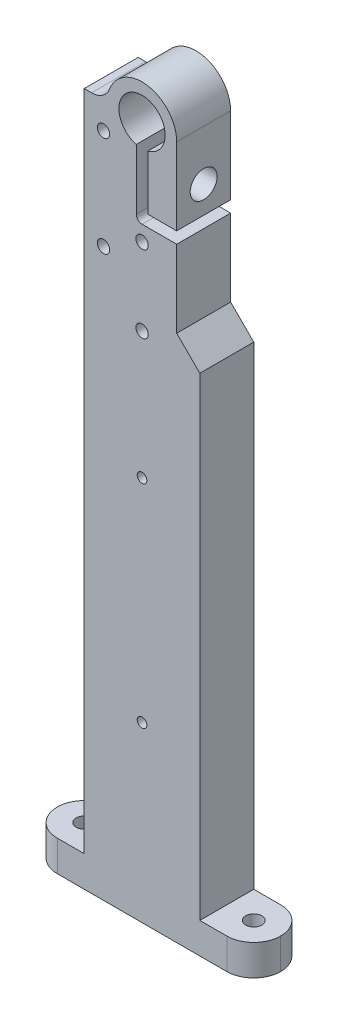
ISO-10303-21;
HEADER;
FILE_DESCRIPTION(('STEP AP214'),'2;1');
FILE_NAME('part.step','',(''),(''),'','','');
FILE_SCHEMA(('AUTOMOTIVE_DESIGN { 1 0 10303 214 1 1 1 1 }'));
ENDSEC;
DATA;
#1=APPLICATION_CONTEXT('core data for automotive mechanical design processes');
#2=APPLICATION_PROTOCOL_DEFINITION('international standard','automotive_design',2000,#1);
#3=PRODUCT_CONTEXT('',#1,'mechanical');
#4=PRODUCT('Part','Part','',(#3));
#5=PRODUCT_RELATED_PRODUCT_CATEGORY('part','',(#4));
#6=PRODUCT_DEFINITION_FORMATION('','',#4);
#7=PRODUCT_DEFINITION_CONTEXT('part definition',#1,'design');
#8=PRODUCT_DEFINITION('design','',#6,#7);
#9=PRODUCT_DEFINITION_SHAPE('','',#8);
#10=(LENGTH_UNIT() NAMED_UNIT(*) SI_UNIT(.MILLI.,.METRE.));
#11=(NAMED_UNIT(*) PLANE_ANGLE_UNIT() SI_UNIT($,.RADIAN.));
#12=(NAMED_UNIT(*) SI_UNIT($,.STERADIAN.) SOLID_ANGLE_UNIT());
#13=UNCERTAINTY_MEASURE_WITH_UNIT(LENGTH_MEASURE(1.E-05),#10,'distance_accuracy_value','');
#14=(GEOMETRIC_REPRESENTATION_CONTEXT(3) GLOBAL_UNCERTAINTY_ASSIGNED_CONTEXT((#13)) GLOBAL_UNIT_ASSIGNED_CONTEXT((#10,
#11,#12)) REPRESENTATION_CONTEXT('',''));
#15=CARTESIAN_POINT('',(0.,0.,0.));
#16=DIRECTION('',(0.,0.,1.));
#17=DIRECTION('',(1.,0.,0.));
#18=AXIS2_PLACEMENT_3D('',#15,#16,#17);
#19=CARTESIAN_POINT('',(0.,0.,14.));
#20=DIRECTION('',(1.,0.,0.));
#21=DIRECTION('',(0.,0.,-1.));
#22=AXIS2_PLACEMENT_3D('',#19,#20,#21);
#23=PLANE('',#22);
#24=CARTESIAN_POINT('',(0.,167.,7.));
#25=DIRECTION('',(1.,0.,0.));
#26=DIRECTION('',(0.,0.,-1.));
#27=AXIS2_PLACEMENT_3D('',#24,#25,#26);
#28=CIRCLE('',#27,2.5);
#29=CARTESIAN_POINT('',(0.,167.,4.5));
#30=VERTEX_POINT('',#29);
#31=EDGE_CURVE('E355',#30,#30,#28,.T.);
#32=ORIENTED_EDGE('',*,*,#31,.T.);
#33=EDGE_LOOP('',(#32));
#34=FACE_BOUND('',#33,.T.);
#35=DIRECTION('',(0.,-1.,0.));
#36=VECTOR('',#35,1.);
#37=CARTESIAN_POINT('',(0.,0.,14.));
#38=LINE('',#37,#36);
#39=CARTESIAN_POINT('',(0.,180.,14.));
#40=VERTEX_POINT('',#39);
#41=CARTESIAN_POINT('',(0.,8.,14.));
#42=VERTEX_POINT('',#41);
#43=EDGE_CURVE('E271',#40,#42,#38,.T.);
#44=ORIENTED_EDGE('',*,*,#43,.F.);
#45=DIRECTION('',(0.,0.,-1.));
#46=VECTOR('',#45,1.);
#47=CARTESIAN_POINT('',(0.,180.,14.));
#48=LINE('',#47,#46);
#49=CARTESIAN_POINT('',(0.,180.,0.));
#50=VERTEX_POINT('',#49);
#51=EDGE_CURVE('E231',#40,#50,#48,.T.);
#52=ORIENTED_EDGE('',*,*,#51,.T.);
#53=DIRECTION('',(0.,-1.,0.));
#54=VECTOR('',#53,1.);
#55=CARTESIAN_POINT('',(0.,0.,0.));
#56=LINE('',#55,#54);
#57=CARTESIAN_POINT('',(0.,8.,0.));
#58=VERTEX_POINT('',#57);
#59=EDGE_CURVE('E275',#50,#58,#56,.T.);
#60=ORIENTED_EDGE('',*,*,#59,.T.);
#61=DIRECTION('',(0.,0.,1.));
#62=VECTOR('',#61,1.);
#63=CARTESIAN_POINT('',(0.,8.,14.));
#64=LINE('',#63,#62);
#65=EDGE_CURVE('E277',#58,#42,#64,.T.);
#66=ORIENTED_EDGE('',*,*,#65,.T.);
#67=EDGE_LOOP('',(#44,#52,#60,#66));
#68=FACE_BOUND('',#67,.T.);
#69=ADVANCED_FACE('F38',(#34,#68),#23,.F.);
#70=CARTESIAN_POINT('',(0.,0.,14.));
#71=DIRECTION('',(0.,1.,0.));
#72=DIRECTION('',(0.,0.,1.));
#73=AXIS2_PLACEMENT_3D('',#70,#71,#72);
#74=PLANE('',#73);
#75=CARTESIAN_POINT('',(37.,0.,7.));
#76=DIRECTION('',(0.,-1.,0.));
#77=DIRECTION('',(0.,0.,-1.));
#78=AXIS2_PLACEMENT_3D('',#75,#76,#77);
#79=CIRCLE('',#78,2.1);
#80=CARTESIAN_POINT('',(37.,0.,4.9));
#81=VERTEX_POINT('',#80);
#82=EDGE_CURVE('E302',#81,#81,#79,.T.);
#83=ORIENTED_EDGE('',*,*,#82,.F.);
#84=EDGE_LOOP('',(#83));
#85=FACE_BOUND('',#84,.T.);
#86=CARTESIAN_POINT('',(-7.,0.,7.));
#87=DIRECTION('',(0.,-1.,0.));
#88=DIRECTION('',(0.,0.,-1.));
#89=AXIS2_PLACEMENT_3D('',#86,#87,#88);
#90=CIRCLE('',#89,2.1);
#91=CARTESIAN_POINT('',(-7.,0.,4.9));
#92=VERTEX_POINT('',#91);
#93=EDGE_CURVE('E295',#92,#92,#90,.T.);
#94=ORIENTED_EDGE('',*,*,#93,.F.);
#95=EDGE_LOOP('',(#94));
#96=FACE_BOUND('',#95,.T.);
#97=DIRECTION('',(1.,0.,0.));
#98=VECTOR('',#97,1.);
#99=CARTESIAN_POINT('',(0.,0.,0.));
#100=LINE('',#99,#98);
#101=CARTESIAN_POINT('',(-7.,0.,0.));
#102=VERTEX_POINT('',#101);
#103=CARTESIAN_POINT('',(37.,0.,0.));
#104=VERTEX_POINT('',#103);
#105=EDGE_CURVE('E272',#102,#104,#100,.T.);
#106=ORIENTED_EDGE('',*,*,#105,.T.);
#107=CARTESIAN_POINT('',(37.,0.,7.));
#108=DIRECTION('',(0.,1.,0.));
#109=DIRECTION('',(0.,0.,1.));
#110=AXIS2_PLACEMENT_3D('',#107,#108,#109);
#111=CIRCLE('',#110,7.);
#112=CARTESIAN_POINT('',(44.,0.,7.));
#113=VERTEX_POINT('',#112);
#114=EDGE_CURVE('E255',#104,#113,#111,.F.);
#115=ORIENTED_EDGE('',*,*,#114,.T.);
#116=CARTESIAN_POINT('',(37.,0.,7.));
#117=DIRECTION('',(0.,1.,0.));
#118=DIRECTION('',(0.,0.,1.));
#119=AXIS2_PLACEMENT_3D('',#116,#117,#118);
#120=CIRCLE('',#119,7.);
#121=CARTESIAN_POINT('',(37.,0.,14.));
#122=VERTEX_POINT('',#121);
#123=EDGE_CURVE('E257',#113,#122,#120,.F.);
#124=ORIENTED_EDGE('',*,*,#123,.T.);
#125=DIRECTION('',(1.,0.,0.));
#126=VECTOR('',#125,1.);
#127=CARTESIAN_POINT('',(0.,0.,14.));
#128=LINE('',#127,#126);
#129=CARTESIAN_POINT('',(-7.,0.,14.));
#130=VERTEX_POINT('',#129);
#131=EDGE_CURVE('E280',#130,#122,#128,.T.);
#132=ORIENTED_EDGE('',*,*,#131,.F.);
#133=CARTESIAN_POINT('',(-7.,0.,7.));
#134=DIRECTION('',(0.,1.,0.));
#135=DIRECTION('',(0.,0.,1.));
#136=AXIS2_PLACEMENT_3D('',#133,#134,#135);
#137=CIRCLE('',#136,7.);
#138=CARTESIAN_POINT('',(-14.,0.,7.));
#139=VERTEX_POINT('',#138);
#140=EDGE_CURVE('E259',#130,#139,#137,.F.);
#141=ORIENTED_EDGE('',*,*,#140,.T.);
#142=CARTESIAN_POINT('',(-7.,0.,7.));
#143=DIRECTION('',(0.,1.,0.));
#144=DIRECTION('',(0.,0.,1.));
#145=AXIS2_PLACEMENT_3D('',#142,#143,#144);
#146=CIRCLE('',#145,7.);
#147=EDGE_CURVE('E261',#139,#102,#146,.F.);
#148=ORIENTED_EDGE('',*,*,#147,.T.);
#149=EDGE_LOOP('',(#106,#115,#124,#132,#141,#148));
#150=FACE_BOUND('',#149,.T.);
#151=ADVANCED_FACE('F438',(#85,#96,#150),#74,.F.);
#152=CARTESIAN_POINT('',(30.,0.,14.));
#153=DIRECTION('',(-1.,0.,0.));
#154=DIRECTION('',(0.,0.,1.));
#155=AXIS2_PLACEMENT_3D('',#152,#153,#154);
#156=PLANE('',#155);
#157=DIRECTION('',(0.,1.,0.));
#158=VECTOR('',#157,1.);
#159=CARTESIAN_POINT('',(30.,0.,0.));
#160=LINE('',#159,#158);
#161=CARTESIAN_POINT('',(30.,8.,0.));
#162=VERTEX_POINT('',#161);
#163=CARTESIAN_POINT('',(30.,131.,0.));
#164=VERTEX_POINT('',#163);
#165=EDGE_CURVE('E269',#162,#164,#160,.T.);
#166=ORIENTED_EDGE('',*,*,#165,.T.);
#167=DIRECTION('',(0.,0.,1.));
#168=VECTOR('',#167,1.);
#169=CARTESIAN_POINT('',(30.,131.,14.));
#170=LINE('',#169,#168);
#171=CARTESIAN_POINT('',(30.,131.,14.));
#172=VERTEX_POINT('',#171);
#173=EDGE_CURVE('E203',#164,#172,#170,.T.);
#174=ORIENTED_EDGE('',*,*,#173,.T.);
#175=DIRECTION('',(0.,1.,0.));
#176=VECTOR('',#175,1.);
#177=CARTESIAN_POINT('',(30.,0.,14.));
#178=LINE('',#177,#176);
#179=CARTESIAN_POINT('',(30.,8.,14.));
#180=VERTEX_POINT('',#179);
#181=EDGE_CURVE('E268',#180,#172,#178,.T.);
#182=ORIENTED_EDGE('',*,*,#181,.F.);
#183=DIRECTION('',(0.,0.,-1.));
#184=VECTOR('',#183,1.);
#185=CARTESIAN_POINT('',(30.,8.,14.));
#186=LINE('',#185,#184);
#187=EDGE_CURVE('E286',#180,#162,#186,.T.);
#188=ORIENTED_EDGE('',*,*,#187,.T.);
#189=EDGE_LOOP('',(#166,#174,#182,#188));
#190=FACE_BOUND('',#189,.T.);
#191=ADVANCED_FACE('F410',(#190),#156,.F.);
#192=CARTESIAN_POINT('',(0.,0.,14.));
#193=DIRECTION('',(0.,0.,-1.));
#194=DIRECTION('',(-1.,0.,0.));
#195=AXIS2_PLACEMENT_3D('',#192,#193,#194);
#196=PLANE('',#195);
#197=CARTESIAN_POINT('',(15.,153.,14.));
#198=DIRECTION('',(0.,0.,1.));
#199=DIRECTION('',(1.,0.,0.));
#200=AXIS2_PLACEMENT_3D('',#197,#198,#199);
#201=CIRCLE('',#200,1.59999999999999);
#202=CARTESIAN_POINT('',(16.6,153.,14.));
#203=VERTEX_POINT('',#202);
#204=EDGE_CURVE('E392',#203,#203,#201,.T.);
#205=ORIENTED_EDGE('',*,*,#204,.F.);
#206=EDGE_LOOP('',(#205));
#207=FACE_BOUND('',#206,.T.);
#208=CARTESIAN_POINT('',(15.,133.,14.));
#209=DIRECTION('',(0.,0.,1.));
#210=DIRECTION('',(1.,0.,0.));
#211=AXIS2_PLACEMENT_3D('',#208,#209,#210);
#212=CIRCLE('',#211,1.59999999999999);
#213=CARTESIAN_POINT('',(16.6,133.,14.));
#214=VERTEX_POINT('',#213);
#215=EDGE_CURVE('E386',#214,#214,#212,.T.);
#216=ORIENTED_EDGE('',*,*,#215,.F.);
#217=EDGE_LOOP('',(#216));
#218=FACE_BOUND('',#217,.T.);
#219=CARTESIAN_POINT('',(15.,100.,14.));
#220=DIRECTION('',(0.,0.,1.));
#221=DIRECTION('',(1.,0.,0.));
#222=AXIS2_PLACEMENT_3D('',#219,#220,#221);
#223=CIRCLE('',#222,1.25);
#224=CARTESIAN_POINT('',(16.25,100.,14.));
#225=VERTEX_POINT('',#224);
#226=EDGE_CURVE('E380',#225,#225,#223,.T.);
#227=ORIENTED_EDGE('',*,*,#226,.F.);
#228=EDGE_LOOP('',(#227));
#229=FACE_BOUND('',#228,.T.);
#230=CARTESIAN_POINT('',(15.,45.,14.));
#231=DIRECTION('',(0.,0.,1.));
#232=DIRECTION('',(1.,0.,0.));
#233=AXIS2_PLACEMENT_3D('',#230,#231,#232);
#234=CIRCLE('',#233,1.25);
#235=CARTESIAN_POINT('',(16.25,45.,14.));
#236=VERTEX_POINT('',#235);
#237=EDGE_CURVE('E374',#236,#236,#234,.T.);
#238=ORIENTED_EDGE('',*,*,#237,.F.);
#239=EDGE_LOOP('',(#238));
#240=FACE_BOUND('',#239,.T.);
#241=CARTESIAN_POINT('',(5.,147.,14.));
#242=DIRECTION('',(0.,0.,1.));
#243=DIRECTION('',(1.,0.,0.));
#244=AXIS2_PLACEMENT_3D('',#241,#242,#243);
#245=CIRCLE('',#244,1.59999999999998);
#246=CARTESIAN_POINT('',(6.59999999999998,147.,14.));
#247=VERTEX_POINT('',#246);
#248=EDGE_CURVE('E368',#247,#247,#245,.T.);
#249=ORIENTED_EDGE('',*,*,#248,.F.);
#250=EDGE_LOOP('',(#249));
#251=FACE_BOUND('',#250,.T.);
#252=CARTESIAN_POINT('',(5.,173.,14.));
#253=DIRECTION('',(0.,0.,1.));
#254=DIRECTION('',(1.,0.,0.));
#255=AXIS2_PLACEMENT_3D('',#252,#253,#254);
#256=CIRCLE('',#255,1.59999999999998);
#257=CARTESIAN_POINT('',(6.59999999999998,173.,14.));
#258=VERTEX_POINT('',#257);
#259=EDGE_CURVE('E362',#258,#258,#256,.T.);
#260=ORIENTED_EDGE('',*,*,#259,.F.);
#261=EDGE_LOOP('',(#260));
#262=FACE_BOUND('',#261,.T.);
#263=ORIENTED_EDGE('',*,*,#181,.T.);
#264=DIRECTION('',(0.707106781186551,-0.707106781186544,0.));
#265=VECTOR('',#264,1.);
#266=CARTESIAN_POINT('',(30.,131.,14.));
#267=LINE('',#266,#265);
#268=CARTESIAN_POINT('',(24.,137.,14.));
#269=VERTEX_POINT('',#268);
#270=EDGE_CURVE('E205',#172,#269,#267,.F.);
#271=ORIENTED_EDGE('',*,*,#270,.T.);
#272=DIRECTION('',(0.,-1.,0.));
#273=VECTOR('',#272,1.);
#274=CARTESIAN_POINT('',(24.,180.,14.));
#275=LINE('',#274,#273);
#276=CARTESIAN_POINT('',(24.,157.,14.));
#277=VERTEX_POINT('',#276);
#278=EDGE_CURVE('E186',#277,#269,#275,.T.);
#279=ORIENTED_EDGE('',*,*,#278,.F.);
#280=DIRECTION('',(1.,0.,0.));
#281=VECTOR('',#280,1.);
#282=CARTESIAN_POINT('',(13.5,157.,14.));
#283=LINE('',#282,#281);
#284=CARTESIAN_POINT('',(15.,157.,14.));
#285=VERTEX_POINT('',#284);
#286=EDGE_CURVE('E330',#285,#277,#283,.T.);
#287=ORIENTED_EDGE('',*,*,#286,.F.);
#288=CARTESIAN_POINT('',(15.,158.5,14.));
#289=DIRECTION('',(0.,0.,-1.));
#290=DIRECTION('',(-1.,0.,0.));
#291=AXIS2_PLACEMENT_3D('',#288,#289,#290);
#292=CIRCLE('',#291,1.5);
#293=CARTESIAN_POINT('',(13.5,158.5,14.));
#294=VERTEX_POINT('',#293);
#295=EDGE_CURVE('E215',#285,#294,#292,.T.);
#296=ORIENTED_EDGE('',*,*,#295,.T.);
#297=DIRECTION('',(0.,-1.,0.));
#298=VECTOR('',#297,1.);
#299=CARTESIAN_POINT('',(13.5,178.245747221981,14.));
#300=LINE('',#299,#298);
#301=CARTESIAN_POINT('',(13.5,174.190524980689,14.));
#302=VERTEX_POINT('',#301);
#303=EDGE_CURVE('E333',#302,#294,#300,.T.);
#304=ORIENTED_EDGE('',*,*,#303,.F.);
#305=CARTESIAN_POINT('',(15.,180.,14.));
#306=DIRECTION('',(0.,0.,1.));
#307=DIRECTION('',(1.,0.,0.));
#308=AXIS2_PLACEMENT_3D('',#305,#306,#307);
#309=CIRCLE('',#308,6.00000000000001);
#310=CARTESIAN_POINT('',(16.5,174.190524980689,14.));
#311=VERTEX_POINT('',#310);
#312=EDGE_CURVE('E242',#311,#302,#309,.T.);
#313=ORIENTED_EDGE('',*,*,#312,.F.);
#314=DIRECTION('',(0.,1.,0.));
#315=VECTOR('',#314,1.);
#316=CARTESIAN_POINT('',(16.5,178.245747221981,14.));
#317=LINE('',#316,#315);
#318=CARTESIAN_POINT('',(16.5,160.,14.));
#319=VERTEX_POINT('',#318);
#320=EDGE_CURVE('E327',#319,#311,#317,.T.);
#321=ORIENTED_EDGE('',*,*,#320,.F.);
#322=DIRECTION('',(-1.,0.,0.));
#323=VECTOR('',#322,1.);
#324=CARTESIAN_POINT('',(13.5,160.,14.));
#325=LINE('',#324,#323);
#326=CARTESIAN_POINT('',(24.,160.,14.));
#327=VERTEX_POINT('',#326);
#328=EDGE_CURVE('E341',#327,#319,#325,.T.);
#329=ORIENTED_EDGE('',*,*,#328,.F.);
#330=DIRECTION('',(0.,-1.,0.));
#331=VECTOR('',#330,1.);
#332=CARTESIAN_POINT('',(24.,180.,14.));
#333=LINE('',#332,#331);
#334=CARTESIAN_POINT('',(24.,180.,14.));
#335=VERTEX_POINT('',#334);
#336=EDGE_CURVE('E318',#335,#327,#333,.T.);
#337=ORIENTED_EDGE('',*,*,#336,.F.);
#338=CARTESIAN_POINT('',(15.,180.,14.));
#339=DIRECTION('',(0.,0.,-1.));
#340=DIRECTION('',(1.,0.,0.));
#341=AXIS2_PLACEMENT_3D('',#338,#339,#340);
#342=CIRCLE('',#341,9.00000000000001);
#343=CARTESIAN_POINT('',(6.59355203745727,183.214285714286,14.));
#344=VERTEX_POINT('',#343);
#345=EDGE_CURVE('E320',#344,#335,#342,.T.);
#346=ORIENTED_EDGE('',*,*,#345,.F.);
#347=CARTESIAN_POINT('',(1.92330316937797,185.,14.));
#348=DIRECTION('',(0.,0.,-1.));
#349=DIRECTION('',(-1.,0.,0.));
#350=AXIS2_PLACEMENT_3D('',#347,#348,#349);
#351=CIRCLE('',#350,5.);
#352=CARTESIAN_POINT('',(1.92330316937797,180.,14.));
#353=VERTEX_POINT('',#352);
#354=EDGE_CURVE('E46',#344,#353,#351,.T.);
#355=ORIENTED_EDGE('',*,*,#354,.T.);
#356=DIRECTION('',(1.,0.,0.));
#357=VECTOR('',#356,1.);
#358=CARTESIAN_POINT('',(5.99999999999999,180.,14.));
#359=LINE('',#358,#357);
#360=EDGE_CURVE('E315',#40,#353,#359,.T.);
#361=ORIENTED_EDGE('',*,*,#360,.F.);
#362=ORIENTED_EDGE('',*,*,#43,.T.);
#363=DIRECTION('',(-1.,0.,0.));
#364=VECTOR('',#363,1.);
#365=CARTESIAN_POINT('',(-14.,8.,14.));
#366=LINE('',#365,#364);
#367=CARTESIAN_POINT('',(-7.,8.,14.));
#368=VERTEX_POINT('',#367);
#369=EDGE_CURVE('E290',#42,#368,#366,.T.);
#370=ORIENTED_EDGE('',*,*,#369,.T.);
#371=DIRECTION('',(0.,-1.,0.));
#372=VECTOR('',#371,1.);
#373=CARTESIAN_POINT('',(-7.,0.,14.));
#374=LINE('',#373,#372);
#375=EDGE_CURVE('E248',#368,#130,#374,.T.);
#376=ORIENTED_EDGE('',*,*,#375,.T.);
#377=ORIENTED_EDGE('',*,*,#131,.T.);
#378=DIRECTION('',(0.,-1.,0.));
#379=VECTOR('',#378,1.);
#380=CARTESIAN_POINT('',(37.,8.,14.));
#381=LINE('',#380,#379);
#382=CARTESIAN_POINT('',(37.,8.,14.));
#383=VERTEX_POINT('',#382);
#384=EDGE_CURVE('E246',#122,#383,#381,.F.);
#385=ORIENTED_EDGE('',*,*,#384,.T.);
#386=EDGE_CURVE('E288',#383,#180,#366,.T.);
#387=ORIENTED_EDGE('',*,*,#386,.T.);
#388=EDGE_LOOP('',(#263,#271,#279,#287,#296,#304,#313,#321,#329,#337,#346,#355,#361,#362,#370,
#376,#377,#385,#387));
#389=FACE_BOUND('',#388,.T.);
#390=ADVANCED_FACE('F407',(#207,#218,#229,#240,#251,#262,#389),#196,.F.);
#391=CARTESIAN_POINT('',(0.,0.,0.));
#392=DIRECTION('',(0.,0.,-1.));
#393=DIRECTION('',(-1.,0.,0.));
#394=AXIS2_PLACEMENT_3D('',#391,#392,#393);
#395=PLANE('',#394);
#396=CARTESIAN_POINT('',(15.,153.,0.));
#397=DIRECTION('',(0.,0.,1.));
#398=DIRECTION('',(1.,0.,0.));
#399=AXIS2_PLACEMENT_3D('',#396,#397,#398);
#400=CIRCLE('',#399,1.59999999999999);
#401=CARTESIAN_POINT('',(16.6,153.,0.));
#402=VERTEX_POINT('',#401);
#403=EDGE_CURVE('E389',#402,#402,#400,.T.);
#404=ORIENTED_EDGE('',*,*,#403,.T.);
#405=EDGE_LOOP('',(#404));
#406=FACE_BOUND('',#405,.T.);
#407=CARTESIAN_POINT('',(15.,133.,0.));
#408=DIRECTION('',(0.,0.,1.));
#409=DIRECTION('',(1.,0.,0.));
#410=AXIS2_PLACEMENT_3D('',#407,#408,#409);
#411=CIRCLE('',#410,1.59999999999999);
#412=CARTESIAN_POINT('',(16.6,133.,0.));
#413=VERTEX_POINT('',#412);
#414=EDGE_CURVE('E383',#413,#413,#411,.T.);
#415=ORIENTED_EDGE('',*,*,#414,.T.);
#416=EDGE_LOOP('',(#415));
#417=FACE_BOUND('',#416,.T.);
#418=CARTESIAN_POINT('',(15.,100.,0.));
#419=DIRECTION('',(0.,0.,1.));
#420=DIRECTION('',(1.,0.,0.));
#421=AXIS2_PLACEMENT_3D('',#418,#419,#420);
#422=CIRCLE('',#421,1.25);
#423=CARTESIAN_POINT('',(16.25,100.,0.));
#424=VERTEX_POINT('',#423);
#425=EDGE_CURVE('E377',#424,#424,#422,.T.);
#426=ORIENTED_EDGE('',*,*,#425,.T.);
#427=EDGE_LOOP('',(#426));
#428=FACE_BOUND('',#427,.T.);
#429=CARTESIAN_POINT('',(15.,45.,0.));
#430=DIRECTION('',(0.,0.,1.));
#431=DIRECTION('',(1.,0.,0.));
#432=AXIS2_PLACEMENT_3D('',#429,#430,#431);
#433=CIRCLE('',#432,1.25);
#434=CARTESIAN_POINT('',(16.25,45.,0.));
#435=VERTEX_POINT('',#434);
#436=EDGE_CURVE('E371',#435,#435,#433,.T.);
#437=ORIENTED_EDGE('',*,*,#436,.T.);
#438=EDGE_LOOP('',(#437));
#439=FACE_BOUND('',#438,.T.);
#440=CARTESIAN_POINT('',(5.,147.,0.));
#441=DIRECTION('',(0.,0.,1.));
#442=DIRECTION('',(1.,0.,0.));
#443=AXIS2_PLACEMENT_3D('',#440,#441,#442);
#444=CIRCLE('',#443,1.59999999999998);
#445=CARTESIAN_POINT('',(6.59999999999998,147.,0.));
#446=VERTEX_POINT('',#445);
#447=EDGE_CURVE('E365',#446,#446,#444,.T.);
#448=ORIENTED_EDGE('',*,*,#447,.T.);
#449=EDGE_LOOP('',(#448));
#450=FACE_BOUND('',#449,.T.);
#451=CARTESIAN_POINT('',(5.,173.,0.));
#452=DIRECTION('',(0.,0.,1.));
#453=DIRECTION('',(1.,0.,0.));
#454=AXIS2_PLACEMENT_3D('',#451,#452,#453);
#455=CIRCLE('',#454,1.59999999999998);
#456=CARTESIAN_POINT('',(6.59999999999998,173.,0.));
#457=VERTEX_POINT('',#456);
#458=EDGE_CURVE('E361',#457,#457,#455,.T.);
#459=ORIENTED_EDGE('',*,*,#458,.T.);
#460=EDGE_LOOP('',(#459));
#461=FACE_BOUND('',#460,.T.);
#462=DIRECTION('',(0.,-1.,0.));
#463=VECTOR('',#462,1.);
#464=CARTESIAN_POINT('',(24.,180.,0.));
#465=LINE('',#464,#463);
#466=CARTESIAN_POINT('',(24.,157.,0.));
#467=VERTEX_POINT('',#466);
#468=CARTESIAN_POINT('',(24.,137.,0.));
#469=VERTEX_POINT('',#468);
#470=EDGE_CURVE('E183',#467,#469,#465,.T.);
#471=ORIENTED_EDGE('',*,*,#470,.T.);
#472=DIRECTION('',(-0.707106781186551,0.707106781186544,0.));
#473=VECTOR('',#472,1.);
#474=CARTESIAN_POINT('',(80.4999999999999,80.5000000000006,0.));
#475=LINE('',#474,#473);
#476=EDGE_CURVE('E195',#469,#164,#475,.F.);
#477=ORIENTED_EDGE('',*,*,#476,.T.);
#478=ORIENTED_EDGE('',*,*,#165,.F.);
#479=DIRECTION('',(1.,0.,0.));
#480=VECTOR('',#479,1.);
#481=CARTESIAN_POINT('',(-14.,8.,0.));
#482=LINE('',#481,#480);
#483=CARTESIAN_POINT('',(37.,8.,0.));
#484=VERTEX_POINT('',#483);
#485=EDGE_CURVE('E294',#162,#484,#482,.T.);
#486=ORIENTED_EDGE('',*,*,#485,.T.);
#487=DIRECTION('',(0.,-1.,0.));
#488=VECTOR('',#487,1.);
#489=CARTESIAN_POINT('',(37.,0.,0.));
#490=LINE('',#489,#488);
#491=EDGE_CURVE('E263',#484,#104,#490,.T.);
#492=ORIENTED_EDGE('',*,*,#491,.T.);
#493=ORIENTED_EDGE('',*,*,#105,.F.);
#494=DIRECTION('',(0.,-1.,0.));
#495=VECTOR('',#494,1.);
#496=CARTESIAN_POINT('',(-7.,0.,0.));
#497=LINE('',#496,#495);
#498=CARTESIAN_POINT('',(-7.,8.,0.));
#499=VERTEX_POINT('',#498);
#500=EDGE_CURVE('E266',#102,#499,#497,.F.);
#501=ORIENTED_EDGE('',*,*,#500,.T.);
#502=EDGE_CURVE('E291',#499,#58,#482,.T.);
#503=ORIENTED_EDGE('',*,*,#502,.T.);
#504=ORIENTED_EDGE('',*,*,#59,.F.);
#505=DIRECTION('',(1.,0.,0.));
#506=VECTOR('',#505,1.);
#507=CARTESIAN_POINT('',(5.99999999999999,180.,0.));
#508=LINE('',#507,#506);
#509=CARTESIAN_POINT('',(1.92330316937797,180.,0.));
#510=VERTEX_POINT('',#509);
#511=EDGE_CURVE('E314',#50,#510,#508,.T.);
#512=ORIENTED_EDGE('',*,*,#511,.T.);
#513=CARTESIAN_POINT('',(1.92330316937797,185.,0.));
#514=DIRECTION('',(0.,0.,-1.));
#515=DIRECTION('',(-1.,0.,0.));
#516=AXIS2_PLACEMENT_3D('',#513,#514,#515);
#517=CIRCLE('',#516,5.);
#518=CARTESIAN_POINT('',(6.59355203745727,183.214285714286,0.));
#519=VERTEX_POINT('',#518);
#520=EDGE_CURVE('E11',#510,#519,#517,.F.);
#521=ORIENTED_EDGE('',*,*,#520,.T.);
#522=CARTESIAN_POINT('',(15.,180.,0.));
#523=DIRECTION('',(0.,0.,-1.));
#524=DIRECTION('',(1.,0.,0.));
#525=AXIS2_PLACEMENT_3D('',#522,#523,#524);
#526=CIRCLE('',#525,9.00000000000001);
#527=CARTESIAN_POINT('',(24.,180.,0.));
#528=VERTEX_POINT('',#527);
#529=EDGE_CURVE('E317',#519,#528,#526,.T.);
#530=ORIENTED_EDGE('',*,*,#529,.T.);
#531=DIRECTION('',(0.,-1.,0.));
#532=VECTOR('',#531,1.);
#533=CARTESIAN_POINT('',(24.,180.,0.));
#534=LINE('',#533,#532);
#535=CARTESIAN_POINT('',(24.,160.,0.));
#536=VERTEX_POINT('',#535);
#537=EDGE_CURVE('E324',#528,#536,#534,.T.);
#538=ORIENTED_EDGE('',*,*,#537,.T.);
#539=DIRECTION('',(-1.,0.,0.));
#540=VECTOR('',#539,1.);
#541=CARTESIAN_POINT('',(13.5,160.,0.));
#542=LINE('',#541,#540);
#543=CARTESIAN_POINT('',(16.5,160.,0.));
#544=VERTEX_POINT('',#543);
#545=EDGE_CURVE('E336',#536,#544,#542,.T.);
#546=ORIENTED_EDGE('',*,*,#545,.T.);
#547=DIRECTION('',(0.,1.,0.));
#548=VECTOR('',#547,1.);
#549=CARTESIAN_POINT('',(16.5,178.245747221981,0.));
#550=LINE('',#549,#548);
#551=CARTESIAN_POINT('',(16.5,174.190524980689,0.));
#552=VERTEX_POINT('',#551);
#553=EDGE_CURVE('E322',#544,#552,#550,.T.);
#554=ORIENTED_EDGE('',*,*,#553,.T.);
#555=CARTESIAN_POINT('',(15.,180.,0.));
#556=DIRECTION('',(0.,0.,1.));
#557=DIRECTION('',(1.,0.,0.));
#558=AXIS2_PLACEMENT_3D('',#555,#556,#557);
#559=CIRCLE('',#558,6.00000000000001);
#560=CARTESIAN_POINT('',(13.5,174.190524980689,0.));
#561=VERTEX_POINT('',#560);
#562=EDGE_CURVE('E305',#552,#561,#559,.T.);
#563=ORIENTED_EDGE('',*,*,#562,.T.);
#564=DIRECTION('',(0.,-1.,0.));
#565=VECTOR('',#564,1.);
#566=CARTESIAN_POINT('',(13.5,178.245747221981,0.));
#567=LINE('',#566,#565);
#568=CARTESIAN_POINT('',(13.5,158.5,0.));
#569=VERTEX_POINT('',#568);
#570=EDGE_CURVE('E329',#561,#569,#567,.T.);
#571=ORIENTED_EDGE('',*,*,#570,.T.);
#572=CARTESIAN_POINT('',(15.,158.5,0.));
#573=DIRECTION('',(0.,0.,-1.));
#574=DIRECTION('',(-1.,0.,0.));
#575=AXIS2_PLACEMENT_3D('',#572,#573,#574);
#576=CIRCLE('',#575,1.5);
#577=CARTESIAN_POINT('',(15.,157.,0.));
#578=VERTEX_POINT('',#577);
#579=EDGE_CURVE('E213',#569,#578,#576,.F.);
#580=ORIENTED_EDGE('',*,*,#579,.T.);
#581=DIRECTION('',(1.,0.,0.));
#582=VECTOR('',#581,1.);
#583=CARTESIAN_POINT('',(13.5,157.,0.));
#584=LINE('',#583,#582);
#585=EDGE_CURVE('E198',#578,#467,#584,.T.);
#586=ORIENTED_EDGE('',*,*,#585,.T.);
#587=EDGE_LOOP('',(#471,#477,#478,#486,#492,#493,#501,#503,#504,#512,#521,#530,#538,#546,#554,
#563,#571,#580,#586));
#588=FACE_BOUND('',#587,.T.);
#589=ADVANCED_FACE('F193',(#406,#417,#428,#439,#450,#461,#588),#395,.T.);
#590=CARTESIAN_POINT('',(0.,8.,0.));
#591=DIRECTION('',(0.,1.,0.));
#592=DIRECTION('',(0.,0.,1.));
#593=AXIS2_PLACEMENT_3D('',#590,#591,#592);
#594=PLANE('',#593);
#595=CARTESIAN_POINT('',(37.,8.,7.));
#596=DIRECTION('',(0.,-1.,0.));
#597=DIRECTION('',(0.,0.,-1.));
#598=AXIS2_PLACEMENT_3D('',#595,#596,#597);
#599=CIRCLE('',#598,2.1);
#600=CARTESIAN_POINT('',(37.,8.,4.9));
#601=VERTEX_POINT('',#600);
#602=EDGE_CURVE('E299',#601,#601,#599,.T.);
#603=ORIENTED_EDGE('',*,*,#602,.T.);
#604=EDGE_LOOP('',(#603));
#605=FACE_BOUND('',#604,.T.);
#606=CARTESIAN_POINT('',(37.,8.,7.));
#607=DIRECTION('',(0.,1.,0.));
#608=DIRECTION('',(0.,0.,1.));
#609=AXIS2_PLACEMENT_3D('',#606,#607,#608);
#610=CIRCLE('',#609,7.);
#611=CARTESIAN_POINT('',(44.,8.,7.));
#612=VERTEX_POINT('',#611);
#613=EDGE_CURVE('E253',#383,#612,#610,.T.);
#614=ORIENTED_EDGE('',*,*,#613,.T.);
#615=CARTESIAN_POINT('',(37.,8.,7.));
#616=DIRECTION('',(0.,1.,0.));
#617=DIRECTION('',(0.,0.,1.));
#618=AXIS2_PLACEMENT_3D('',#615,#616,#617);
#619=CIRCLE('',#618,7.);
#620=EDGE_CURVE('E251',#612,#484,#619,.T.);
#621=ORIENTED_EDGE('',*,*,#620,.T.);
#622=ORIENTED_EDGE('',*,*,#485,.F.);
#623=ORIENTED_EDGE('',*,*,#187,.F.);
#624=ORIENTED_EDGE('',*,*,#386,.F.);
#625=EDGE_LOOP('',(#614,#621,#622,#623,#624));
#626=FACE_BOUND('',#625,.T.);
#627=ADVANCED_FACE('F427',(#605,#626),#594,.T.);
#628=CARTESIAN_POINT('',(-7.,8.,7.));
#629=DIRECTION('',(0.,-1.,0.));
#630=DIRECTION('',(0.,0.,-1.));
#631=AXIS2_PLACEMENT_3D('',#628,#629,#630);
#632=CIRCLE('',#631,2.1);
#633=CARTESIAN_POINT('',(-7.,8.,4.9));
#634=VERTEX_POINT('',#633);
#635=EDGE_CURVE('E298',#634,#634,#632,.T.);
#636=ORIENTED_EDGE('',*,*,#635,.T.);
#637=EDGE_LOOP('',(#636));
#638=FACE_BOUND('',#637,.T.);
#639=CARTESIAN_POINT('',(-7.,8.,7.));
#640=DIRECTION('',(0.,1.,0.));
#641=DIRECTION('',(0.,0.,1.));
#642=AXIS2_PLACEMENT_3D('',#639,#640,#641);
#643=CIRCLE('',#642,7.);
#644=CARTESIAN_POINT('',(-14.,8.,7.));
#645=VERTEX_POINT('',#644);
#646=EDGE_CURVE('E244',#499,#645,#643,.T.);
#647=ORIENTED_EDGE('',*,*,#646,.T.);
#648=CARTESIAN_POINT('',(-7.,8.,7.));
#649=DIRECTION('',(0.,1.,0.));
#650=DIRECTION('',(0.,0.,1.));
#651=AXIS2_PLACEMENT_3D('',#648,#649,#650);
#652=CIRCLE('',#651,7.);
#653=EDGE_CURVE('E234',#645,#368,#652,.T.);
#654=ORIENTED_EDGE('',*,*,#653,.T.);
#655=ORIENTED_EDGE('',*,*,#369,.F.);
#656=ORIENTED_EDGE('',*,*,#65,.F.);
#657=ORIENTED_EDGE('',*,*,#502,.F.);
#658=EDGE_LOOP('',(#647,#654,#655,#656,#657));
#659=FACE_BOUND('',#658,.T.);
#660=ADVANCED_FACE('F456',(#638,#659),#594,.T.);
#661=CARTESIAN_POINT('',(-7.,8.,7.));
#662=DIRECTION('',(0.,-1.,0.));
#663=DIRECTION('',(0.,0.,-1.));
#664=AXIS2_PLACEMENT_3D('',#661,#662,#663);
#665=CYLINDRICAL_SURFACE('',#664,2.1);
#666=ORIENTED_EDGE('',*,*,#635,.F.);
#667=EDGE_LOOP('',(#666));
#668=FACE_BOUND('',#667,.T.);
#669=ORIENTED_EDGE('',*,*,#93,.T.);
#670=EDGE_LOOP('',(#669));
#671=FACE_BOUND('',#670,.T.);
#672=ADVANCED_FACE('F723',(#668,#671),#665,.F.);
#673=CARTESIAN_POINT('',(37.,8.,7.));
#674=DIRECTION('',(0.,-1.,0.));
#675=DIRECTION('',(0.,0.,-1.));
#676=AXIS2_PLACEMENT_3D('',#673,#674,#675);
#677=CYLINDRICAL_SURFACE('',#676,2.1);
#678=ORIENTED_EDGE('',*,*,#602,.F.);
#679=EDGE_LOOP('',(#678));
#680=FACE_BOUND('',#679,.T.);
#681=ORIENTED_EDGE('',*,*,#82,.T.);
#682=EDGE_LOOP('',(#681));
#683=FACE_BOUND('',#682,.T.);
#684=ADVANCED_FACE('F720',(#680,#683),#677,.F.);
#685=CARTESIAN_POINT('',(15.,180.,0.));
#686=DIRECTION('',(0.,0.,1.));
#687=DIRECTION('',(1.,0.,0.));
#688=AXIS2_PLACEMENT_3D('',#685,#686,#687);
#689=CYLINDRICAL_SURFACE('',#688,6.00000000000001);
#690=ORIENTED_EDGE('',*,*,#312,.T.);
#691=DIRECTION('',(0.,0.,1.));
#692=VECTOR('',#691,1.);
#693=CARTESIAN_POINT('',(13.5,174.190524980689,0.));
#694=LINE('',#693,#692);
#695=EDGE_CURVE('E225',#302,#561,#694,.F.);
#696=ORIENTED_EDGE('',*,*,#695,.T.);
#697=ORIENTED_EDGE('',*,*,#562,.F.);
#698=DIRECTION('',(0.,0.,1.));
#699=VECTOR('',#698,1.);
#700=CARTESIAN_POINT('',(16.5,174.190524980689,0.));
#701=LINE('',#700,#699);
#702=EDGE_CURVE('E228',#552,#311,#701,.T.);
#703=ORIENTED_EDGE('',*,*,#702,.T.);
#704=EDGE_LOOP('',(#690,#696,#697,#703));
#705=FACE_BOUND('',#704,.T.);
#706=ADVANCED_FACE('F487',(#705),#689,.F.);
#707=CARTESIAN_POINT('',(37.,8.,7.));
#708=DIRECTION('',(0.,1.,0.));
#709=DIRECTION('',(0.,0.,1.));
#710=AXIS2_PLACEMENT_3D('',#707,#708,#709);
#711=CYLINDRICAL_SURFACE('',#710,7.);
#712=DIRECTION('',(0.,-1.,0.));
#713=VECTOR('',#712,1.);
#714=CARTESIAN_POINT('',(44.,0.,7.));
#715=LINE('',#714,#713);
#716=EDGE_CURVE('E238',#612,#113,#715,.T.);
#717=ORIENTED_EDGE('',*,*,#716,.F.);
#718=ORIENTED_EDGE('',*,*,#613,.F.);
#719=ORIENTED_EDGE('',*,*,#384,.F.);
#720=ORIENTED_EDGE('',*,*,#123,.F.);
#721=EDGE_LOOP('',(#717,#718,#719,#720));
#722=FACE_BOUND('',#721,.T.);
#723=ADVANCED_FACE('F442',(#722),#711,.T.);
#724=CARTESIAN_POINT('',(37.,0.,7.));
#725=DIRECTION('',(0.,-1.,0.));
#726=DIRECTION('',(0.,0.,-1.));
#727=AXIS2_PLACEMENT_3D('',#724,#725,#726);
#728=CYLINDRICAL_SURFACE('',#727,7.);
#729=ORIENTED_EDGE('',*,*,#620,.F.);
#730=ORIENTED_EDGE('',*,*,#716,.T.);
#731=ORIENTED_EDGE('',*,*,#114,.F.);
#732=ORIENTED_EDGE('',*,*,#491,.F.);
#733=EDGE_LOOP('',(#729,#730,#731,#732));
#734=FACE_BOUND('',#733,.T.);
#735=ADVANCED_FACE('F434',(#734),#728,.T.);
#736=CARTESIAN_POINT('',(-7.,8.,7.));
#737=DIRECTION('',(0.,-1.,0.));
#738=DIRECTION('',(0.,0.,-1.));
#739=AXIS2_PLACEMENT_3D('',#736,#737,#738);
#740=CYLINDRICAL_SURFACE('',#739,7.);
#741=DIRECTION('',(0.,-1.,0.));
#742=VECTOR('',#741,1.);
#743=CARTESIAN_POINT('',(-14.,8.,7.));
#744=LINE('',#743,#742);
#745=EDGE_CURVE('E235',#645,#139,#744,.T.);
#746=ORIENTED_EDGE('',*,*,#745,.F.);
#747=ORIENTED_EDGE('',*,*,#646,.F.);
#748=ORIENTED_EDGE('',*,*,#500,.F.);
#749=ORIENTED_EDGE('',*,*,#147,.F.);
#750=EDGE_LOOP('',(#746,#747,#748,#749));
#751=FACE_BOUND('',#750,.T.);
#752=ADVANCED_FACE('F450',(#751),#740,.T.);
#753=CARTESIAN_POINT('',(-7.,0.,7.));
#754=DIRECTION('',(0.,1.,0.));
#755=DIRECTION('',(0.,0.,1.));
#756=AXIS2_PLACEMENT_3D('',#753,#754,#755);
#757=CYLINDRICAL_SURFACE('',#756,7.);
#758=ORIENTED_EDGE('',*,*,#653,.F.);
#759=ORIENTED_EDGE('',*,*,#745,.T.);
#760=ORIENTED_EDGE('',*,*,#140,.F.);
#761=ORIENTED_EDGE('',*,*,#375,.F.);
#762=EDGE_LOOP('',(#758,#759,#760,#761));
#763=FACE_BOUND('',#762,.T.);
#764=ADVANCED_FACE('F453',(#763),#757,.T.);
#765=CARTESIAN_POINT('',(15.,180.,0.));
#766=DIRECTION('',(0.,0.,1.));
#767=DIRECTION('',(1.,0.,0.));
#768=AXIS2_PLACEMENT_3D('',#765,#766,#767);
#769=CYLINDRICAL_SURFACE('',#768,9.00000000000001);
#770=ORIENTED_EDGE('',*,*,#529,.F.);
#771=DIRECTION('',(0.,0.,1.));
#772=VECTOR('',#771,1.);
#773=CARTESIAN_POINT('',(6.59355203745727,183.214285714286,0.));
#774=LINE('',#773,#772);
#775=EDGE_CURVE('E204',#519,#344,#774,.T.);
#776=ORIENTED_EDGE('',*,*,#775,.T.);
#777=ORIENTED_EDGE('',*,*,#345,.T.);
#778=DIRECTION('',(0.,0.,1.));
#779=VECTOR('',#778,1.);
#780=CARTESIAN_POINT('',(24.,180.,0.));
#781=LINE('',#780,#779);
#782=EDGE_CURVE('E239',#528,#335,#781,.T.);
#783=ORIENTED_EDGE('',*,*,#782,.F.);
#784=EDGE_LOOP('',(#770,#776,#777,#783));
#785=FACE_BOUND('',#784,.T.);
#786=ADVANCED_FACE('F467',(#785),#769,.T.);
#787=CARTESIAN_POINT('',(5.99999999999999,180.,0.));
#788=DIRECTION('',(0.,-1.,0.));
#789=DIRECTION('',(0.,0.,-1.));
#790=AXIS2_PLACEMENT_3D('',#787,#788,#789);
#791=PLANE('',#790);
#792=ORIENTED_EDGE('',*,*,#360,.T.);
#793=DIRECTION('',(0.,0.,-1.));
#794=VECTOR('',#793,1.);
#795=CARTESIAN_POINT('',(1.92330316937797,180.,0.));
#796=LINE('',#795,#794);
#797=EDGE_CURVE('E53',#353,#510,#796,.T.);
#798=ORIENTED_EDGE('',*,*,#797,.T.);
#799=ORIENTED_EDGE('',*,*,#511,.F.);
#800=ORIENTED_EDGE('',*,*,#51,.F.);
#801=EDGE_LOOP('',(#792,#798,#799,#800));
#802=FACE_BOUND('',#801,.T.);
#803=ADVANCED_FACE('F613',(#802),#791,.F.);
#804=CARTESIAN_POINT('',(24.,180.,0.));
#805=DIRECTION('',(-1.,0.,0.));
#806=DIRECTION('',(0.,0.,1.));
#807=AXIS2_PLACEMENT_3D('',#804,#805,#806);
#808=PLANE('',#807);
#809=CARTESIAN_POINT('',(24.,167.,7.));
#810=DIRECTION('',(1.,0.,0.));
#811=DIRECTION('',(0.,0.,-1.));
#812=AXIS2_PLACEMENT_3D('',#809,#810,#811);
#813=CIRCLE('',#812,3.5);
#814=CARTESIAN_POINT('',(24.,167.,3.5));
#815=VERTEX_POINT('',#814);
#816=EDGE_CURVE('E352',#815,#815,#813,.T.);
#817=ORIENTED_EDGE('',*,*,#816,.F.);
#818=EDGE_LOOP('',(#817));
#819=FACE_BOUND('',#818,.T.);
#820=ORIENTED_EDGE('',*,*,#336,.T.);
#821=DIRECTION('',(0.,0.,1.));
#822=VECTOR('',#821,1.);
#823=CARTESIAN_POINT('',(24.,160.,0.));
#824=LINE('',#823,#822);
#825=EDGE_CURVE('E343',#536,#327,#824,.T.);
#826=ORIENTED_EDGE('',*,*,#825,.F.);
#827=ORIENTED_EDGE('',*,*,#537,.F.);
#828=ORIENTED_EDGE('',*,*,#782,.T.);
#829=EDGE_LOOP('',(#820,#826,#827,#828));
#830=FACE_BOUND('',#829,.T.);
#831=ADVANCED_FACE('F474',(#819,#830),#808,.F.);
#832=CARTESIAN_POINT('',(13.5,178.245747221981,0.));
#833=DIRECTION('',(-1.,0.,0.));
#834=DIRECTION('',(0.,-1.,0.));
#835=AXIS2_PLACEMENT_3D('',#832,#833,#834);
#836=PLANE('',#835);
#837=CARTESIAN_POINT('',(13.5,167.,7.));
#838=DIRECTION('',(1.,0.,0.));
#839=DIRECTION('',(0.,1.,0.));
#840=AXIS2_PLACEMENT_3D('',#837,#838,#839);
#841=CIRCLE('',#840,2.5);
#842=CARTESIAN_POINT('',(13.5,169.5,7.));
#843=VERTEX_POINT('',#842);
#844=EDGE_CURVE('E358',#843,#843,#841,.T.);
#845=ORIENTED_EDGE('',*,*,#844,.F.);
#846=EDGE_LOOP('',(#845));
#847=FACE_BOUND('',#846,.T.);
#848=ORIENTED_EDGE('',*,*,#303,.T.);
#849=DIRECTION('',(0.,0.,1.));
#850=VECTOR('',#849,1.);
#851=CARTESIAN_POINT('',(13.5,158.5,0.));
#852=LINE('',#851,#850);
#853=EDGE_CURVE('E217',#294,#569,#852,.F.);
#854=ORIENTED_EDGE('',*,*,#853,.T.);
#855=ORIENTED_EDGE('',*,*,#570,.F.);
#856=ORIENTED_EDGE('',*,*,#695,.F.);
#857=EDGE_LOOP('',(#848,#854,#855,#856));
#858=FACE_BOUND('',#857,.T.);
#859=ADVANCED_FACE('F490',(#847,#858),#836,.F.);
#860=CARTESIAN_POINT('',(16.5,178.245747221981,0.));
#861=DIRECTION('',(1.,0.,0.));
#862=DIRECTION('',(0.,1.,0.));
#863=AXIS2_PLACEMENT_3D('',#860,#861,#862);
#864=PLANE('',#863);
#865=CARTESIAN_POINT('',(16.5,167.,7.));
#866=DIRECTION('',(1.,0.,0.));
#867=DIRECTION('',(0.,1.,0.));
#868=AXIS2_PLACEMENT_3D('',#865,#866,#867);
#869=CIRCLE('',#868,3.5);
#870=CARTESIAN_POINT('',(16.5,170.5,7.));
#871=VERTEX_POINT('',#870);
#872=EDGE_CURVE('E348',#871,#871,#869,.F.);
#873=ORIENTED_EDGE('',*,*,#872,.F.);
#874=EDGE_LOOP('',(#873));
#875=FACE_BOUND('',#874,.T.);
#876=ORIENTED_EDGE('',*,*,#553,.F.);
#877=DIRECTION('',(0.,0.,1.));
#878=VECTOR('',#877,1.);
#879=CARTESIAN_POINT('',(16.5,160.,0.));
#880=LINE('',#879,#878);
#881=EDGE_CURVE('E222',#544,#319,#880,.T.);
#882=ORIENTED_EDGE('',*,*,#881,.T.);
#883=ORIENTED_EDGE('',*,*,#320,.T.);
#884=ORIENTED_EDGE('',*,*,#702,.F.);
#885=EDGE_LOOP('',(#876,#882,#883,#884));
#886=FACE_BOUND('',#885,.T.);
#887=ADVANCED_FACE('F484',(#875,#886),#864,.F.);
#888=CARTESIAN_POINT('',(13.5,157.,0.));
#889=DIRECTION('',(0.,-1.,0.));
#890=DIRECTION('',(0.,0.,-1.));
#891=AXIS2_PLACEMENT_3D('',#888,#889,#890);
#892=PLANE('',#891);
#893=ORIENTED_EDGE('',*,*,#286,.T.);
#894=DIRECTION('',(0.,0.,-1.));
#895=VECTOR('',#894,1.);
#896=CARTESIAN_POINT('',(24.,157.,0.));
#897=LINE('',#896,#895);
#898=EDGE_CURVE('E189',#277,#467,#897,.T.);
#899=ORIENTED_EDGE('',*,*,#898,.T.);
#900=ORIENTED_EDGE('',*,*,#585,.F.);
#901=DIRECTION('',(0.,0.,1.));
#902=VECTOR('',#901,1.);
#903=CARTESIAN_POINT('',(15.,157.,14.));
#904=LINE('',#903,#902);
#905=EDGE_CURVE('E219',#578,#285,#904,.T.);
#906=ORIENTED_EDGE('',*,*,#905,.T.);
#907=EDGE_LOOP('',(#893,#899,#900,#906));
#908=FACE_BOUND('',#907,.T.);
#909=ADVANCED_FACE('F498',(#908),#892,.F.);
#910=CARTESIAN_POINT('',(13.5,160.,0.));
#911=DIRECTION('',(0.,1.,0.));
#912=DIRECTION('',(0.,0.,1.));
#913=AXIS2_PLACEMENT_3D('',#910,#911,#912);
#914=PLANE('',#913);
#915=ORIENTED_EDGE('',*,*,#545,.F.);
#916=ORIENTED_EDGE('',*,*,#825,.T.);
#917=ORIENTED_EDGE('',*,*,#328,.T.);
#918=ORIENTED_EDGE('',*,*,#881,.F.);
#919=EDGE_LOOP('',(#915,#916,#917,#918));
#920=FACE_BOUND('',#919,.T.);
#921=ADVANCED_FACE('F478',(#920),#914,.F.);
#922=CARTESIAN_POINT('',(15.,158.5,0.));
#923=DIRECTION('',(0.,0.,-1.));
#924=DIRECTION('',(-1.,0.,0.));
#925=AXIS2_PLACEMENT_3D('',#922,#923,#924);
#926=CYLINDRICAL_SURFACE('',#925,1.5);
#927=ORIENTED_EDGE('',*,*,#579,.F.);
#928=ORIENTED_EDGE('',*,*,#853,.F.);
#929=ORIENTED_EDGE('',*,*,#295,.F.);
#930=ORIENTED_EDGE('',*,*,#905,.F.);
#931=EDGE_LOOP('',(#927,#928,#929,#930));
#932=FACE_BOUND('',#931,.T.);
#933=ADVANCED_FACE('F496',(#932),#926,.F.);
#934=CARTESIAN_POINT('',(24.,180.,0.));
#935=DIRECTION('',(-1.,0.,0.));
#936=DIRECTION('',(0.,-1.,0.));
#937=AXIS2_PLACEMENT_3D('',#934,#935,#936);
#938=PLANE('',#937);
#939=ORIENTED_EDGE('',*,*,#278,.T.);
#940=DIRECTION('',(0.,0.,1.));
#941=VECTOR('',#940,1.);
#942=CARTESIAN_POINT('',(24.,137.,0.));
#943=LINE('',#942,#941);
#944=EDGE_CURVE('E180',#469,#269,#943,.T.);
#945=ORIENTED_EDGE('',*,*,#944,.F.);
#946=ORIENTED_EDGE('',*,*,#470,.F.);
#947=ORIENTED_EDGE('',*,*,#898,.F.);
#948=EDGE_LOOP('',(#939,#945,#946,#947));
#949=FACE_BOUND('',#948,.T.);
#950=ADVANCED_FACE('F182',(#949),#938,.F.);
#951=CARTESIAN_POINT('',(30.,131.,14.));
#952=DIRECTION('',(-0.707106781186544,-0.707106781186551,0.));
#953=DIRECTION('',(0.,0.,1.));
#954=AXIS2_PLACEMENT_3D('',#951,#952,#953);
#955=PLANE('',#954);
#956=ORIENTED_EDGE('',*,*,#476,.F.);
#957=ORIENTED_EDGE('',*,*,#944,.T.);
#958=ORIENTED_EDGE('',*,*,#270,.F.);
#959=ORIENTED_EDGE('',*,*,#173,.F.);
#960=EDGE_LOOP('',(#956,#957,#958,#959));
#961=FACE_BOUND('',#960,.T.);
#962=ADVANCED_FACE('F201',(#961),#955,.F.);
#963=CARTESIAN_POINT('',(1.92330316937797,185.,0.));
#964=DIRECTION('',(0.,0.,1.));
#965=DIRECTION('',(1.,0.,0.));
#966=AXIS2_PLACEMENT_3D('',#963,#964,#965);
#967=CYLINDRICAL_SURFACE('',#966,5.);
#968=ORIENTED_EDGE('',*,*,#520,.F.);
#969=ORIENTED_EDGE('',*,*,#797,.F.);
#970=ORIENTED_EDGE('',*,*,#354,.F.);
#971=ORIENTED_EDGE('',*,*,#775,.F.);
#972=EDGE_LOOP('',(#968,#969,#970,#971));
#973=FACE_BOUND('',#972,.T.);
#974=ADVANCED_FACE('F40',(#973),#967,.F.);
#975=CARTESIAN_POINT('',(6.60050506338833,167.,7.));
#976=DIRECTION('',(1.,0.,0.));
#977=DIRECTION('',(0.,0.,-1.));
#978=AXIS2_PLACEMENT_3D('',#975,#976,#977);
#979=CYLINDRICAL_SURFACE('',#978,3.5);
#980=ORIENTED_EDGE('',*,*,#872,.T.);
#981=EDGE_LOOP('',(#980));
#982=FACE_BOUND('',#981,.T.);
#983=ORIENTED_EDGE('',*,*,#816,.T.);
#984=EDGE_LOOP('',(#983));
#985=FACE_BOUND('',#984,.T.);
#986=ADVANCED_FACE('F535',(#982,#985),#979,.F.);
#987=CARTESIAN_POINT('',(-14.,167.,7.));
#988=DIRECTION('',(1.,0.,0.));
#989=DIRECTION('',(0.,1.,0.));
#990=AXIS2_PLACEMENT_3D('',#987,#988,#989);
#991=CYLINDRICAL_SURFACE('',#990,2.5);
#992=ORIENTED_EDGE('',*,*,#844,.T.);
#993=EDGE_LOOP('',(#992));
#994=FACE_BOUND('',#993,.T.);
#995=ORIENTED_EDGE('',*,*,#31,.F.);
#996=EDGE_LOOP('',(#995));
#997=FACE_BOUND('',#996,.T.);
#998=ADVANCED_FACE('F542',(#994,#997),#991,.F.);
#999=CARTESIAN_POINT('',(5.,173.,0.));
#1000=DIRECTION('',(0.,0.,1.));
#1001=DIRECTION('',(1.,0.,0.));
#1002=AXIS2_PLACEMENT_3D('',#999,#1000,#1001);
#1003=CYLINDRICAL_SURFACE('',#1002,1.59999999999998);
#1004=ORIENTED_EDGE('',*,*,#458,.F.);
#1005=EDGE_LOOP('',(#1004));
#1006=FACE_BOUND('',#1005,.T.);
#1007=ORIENTED_EDGE('',*,*,#259,.T.);
#1008=EDGE_LOOP('',(#1007));
#1009=FACE_BOUND('',#1008,.T.);
#1010=ADVANCED_FACE('F546',(#1006,#1009),#1003,.F.);
#1011=CARTESIAN_POINT('',(5.,147.,0.));
#1012=DIRECTION('',(0.,0.,1.));
#1013=DIRECTION('',(1.,0.,0.));
#1014=AXIS2_PLACEMENT_3D('',#1011,#1012,#1013);
#1015=CYLINDRICAL_SURFACE('',#1014,1.59999999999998);
#1016=ORIENTED_EDGE('',*,*,#447,.F.);
#1017=EDGE_LOOP('',(#1016));
#1018=FACE_BOUND('',#1017,.T.);
#1019=ORIENTED_EDGE('',*,*,#248,.T.);
#1020=EDGE_LOOP('',(#1019));
#1021=FACE_BOUND('',#1020,.T.);
#1022=ADVANCED_FACE('F550',(#1018,#1021),#1015,.F.);
#1023=CARTESIAN_POINT('',(15.,45.,0.));
#1024=DIRECTION('',(0.,0.,1.));
#1025=DIRECTION('',(1.,0.,0.));
#1026=AXIS2_PLACEMENT_3D('',#1023,#1024,#1025);
#1027=CYLINDRICAL_SURFACE('',#1026,1.25);
#1028=ORIENTED_EDGE('',*,*,#436,.F.);
#1029=EDGE_LOOP('',(#1028));
#1030=FACE_BOUND('',#1029,.T.);
#1031=ORIENTED_EDGE('',*,*,#237,.T.);
#1032=EDGE_LOOP('',(#1031));
#1033=FACE_BOUND('',#1032,.T.);
#1034=ADVANCED_FACE('F554',(#1030,#1033),#1027,.F.);
#1035=CARTESIAN_POINT('',(15.,100.,0.));
#1036=DIRECTION('',(0.,0.,1.));
#1037=DIRECTION('',(1.,0.,0.));
#1038=AXIS2_PLACEMENT_3D('',#1035,#1036,#1037);
#1039=CYLINDRICAL_SURFACE('',#1038,1.25);
#1040=ORIENTED_EDGE('',*,*,#425,.F.);
#1041=EDGE_LOOP('',(#1040));
#1042=FACE_BOUND('',#1041,.T.);
#1043=ORIENTED_EDGE('',*,*,#226,.T.);
#1044=EDGE_LOOP('',(#1043));
#1045=FACE_BOUND('',#1044,.T.);
#1046=ADVANCED_FACE('F558',(#1042,#1045),#1039,.F.);
#1047=CARTESIAN_POINT('',(15.,133.,0.));
#1048=DIRECTION('',(0.,0.,1.));
#1049=DIRECTION('',(1.,0.,0.));
#1050=AXIS2_PLACEMENT_3D('',#1047,#1048,#1049);
#1051=CYLINDRICAL_SURFACE('',#1050,1.59999999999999);
#1052=ORIENTED_EDGE('',*,*,#414,.F.);
#1053=EDGE_LOOP('',(#1052));
#1054=FACE_BOUND('',#1053,.T.);
#1055=ORIENTED_EDGE('',*,*,#215,.T.);
#1056=EDGE_LOOP('',(#1055));
#1057=FACE_BOUND('',#1056,.T.);
#1058=ADVANCED_FACE('F403',(#1054,#1057),#1051,.F.);
#1059=CARTESIAN_POINT('',(15.,153.,0.));
#1060=DIRECTION('',(0.,0.,1.));
#1061=DIRECTION('',(1.,0.,0.));
#1062=AXIS2_PLACEMENT_3D('',#1059,#1060,#1061);
#1063=CYLINDRICAL_SURFACE('',#1062,1.59999999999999);
#1064=ORIENTED_EDGE('',*,*,#403,.F.);
#1065=EDGE_LOOP('',(#1064));
#1066=FACE_BOUND('',#1065,.T.);
#1067=ORIENTED_EDGE('',*,*,#204,.T.);
#1068=EDGE_LOOP('',(#1067));
#1069=FACE_BOUND('',#1068,.T.);
#1070=ADVANCED_FACE('F400',(#1066,#1069),#1063,.F.);
#1071=CLOSED_SHELL('',(#69,#151,#191,#390,#589,#627,#660,#672,#684,#706,#723,#735,#752,#764,
#786,#803,#831,#859,#887,#909,#921,#933,#950,#962,#974,#986,#998,#1010,#1022,#1034,#1046,#1058,#1070));
#1072=MANIFOLD_SOLID_BREP('B2',#1071);
#1073=ADVANCED_BREP_SHAPE_REPRESENTATION('',(#18,#1072),#14);
#1074=SHAPE_DEFINITION_REPRESENTATION(#9,#1073);
ENDSEC;
END-ISO-10303-21;
